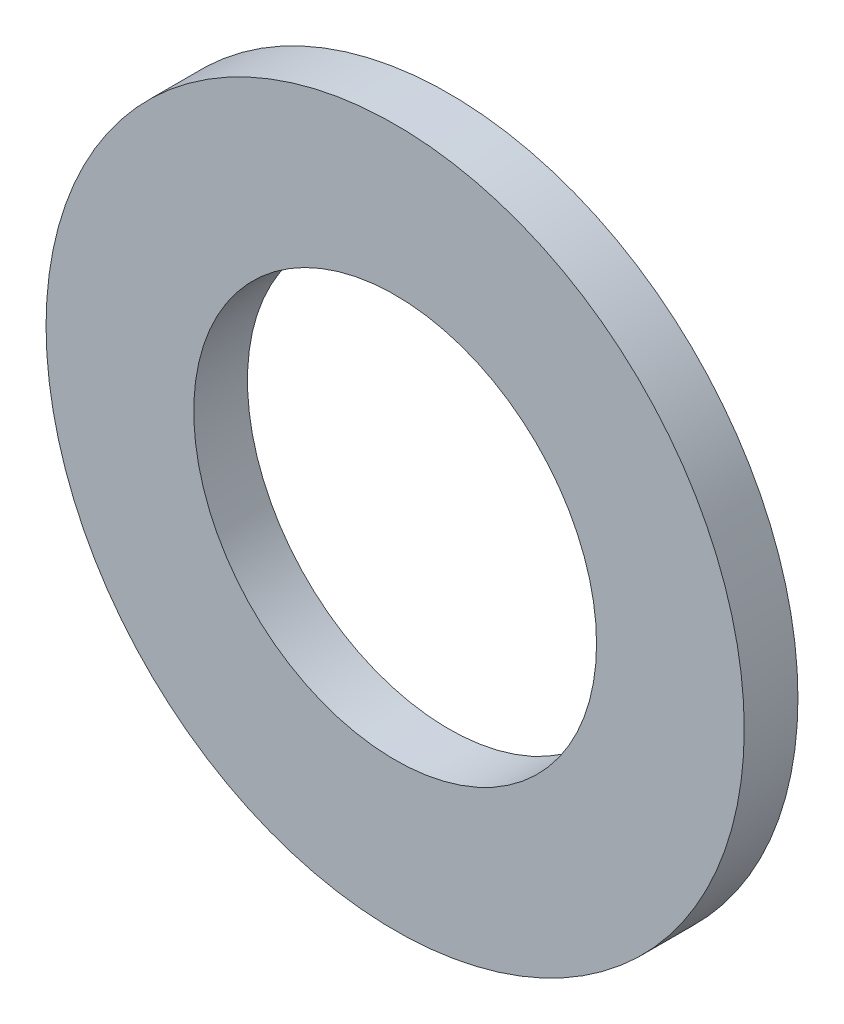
from build123d import *

# Parameters (mm, degrees)
ESQUISSE1_R      = 26
ESQUISSE1_R_2    = 15
EXTRUSION1_DEPTH = 4


with BuildPart() as part:
    # Esquisse1 → Extrusion1 (new body)
    with BuildSketch(Plane.XY):
        Circle(ESQUISSE1_R)
        Circle(ESQUISSE1_R_2, mode=Mode.SUBTRACT)
    extrude(amount=EXTRUSION1_DEPTH)


solid = part.part
